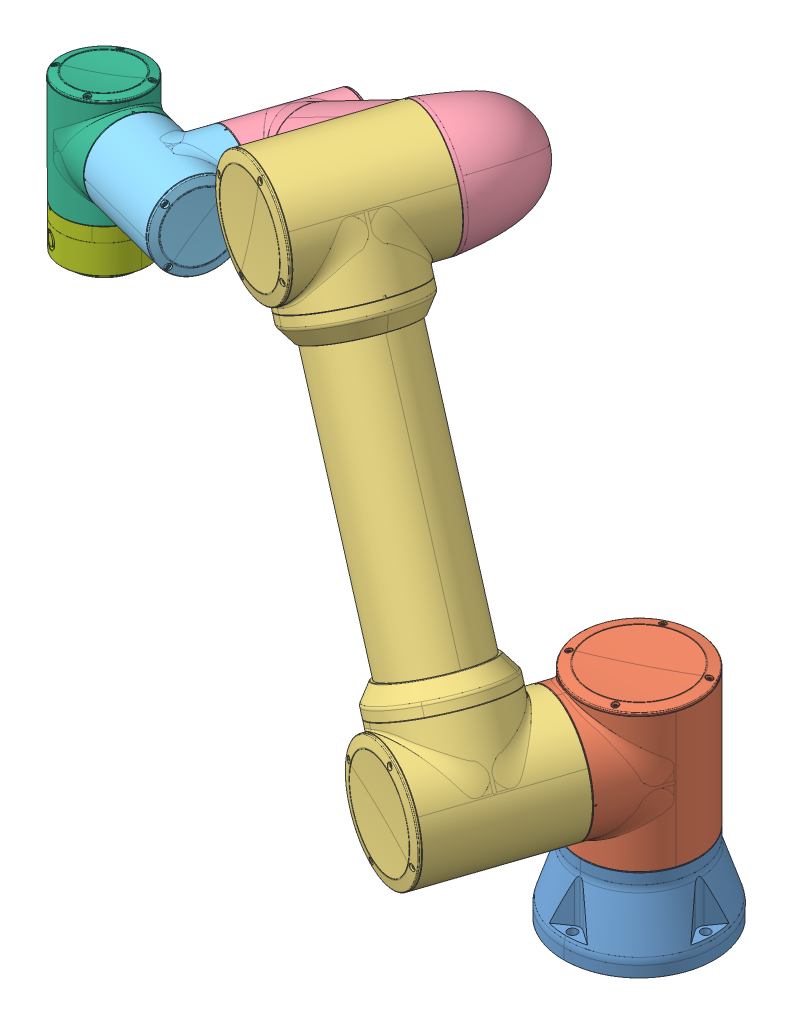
SolidWorks assembly FR5-V6.0 Model.SLDASM, configuration Výchozí (file format 8000). Lengths in mm.
Overall size (783.52 616.67 467.75).
7 component instances, 7 part files, 12 mates.
Components (placement in the parent):
- RD20-FR5-V6.0-1-1: RD20-FR5-V6.0-1.sldprt [Výchozí] at origin size (149.02 80.07 149)
- RD20-FR5-V6.0-2-1: RD20-FR5-V6.0-2.sldprt [Výchozí] at (0 0 0) x (0.947866 0 0.318668) z (-0.318668 0 0.947866) size (135.4 146.14 135.4)
- RD20-FR5-V6.0-3-1: RD20-FR5-V6.0-3.sldprt [Výchozí] at (-126.3044 78.9919 -42.6739) x (0.455276 -0.877095 0.153061) z (-0.318668 0 0.947866) size (560.4 135.4 146.14)
- RD20-FR5-V6.0-4-1: RD20-FR5-V6.0-4.sldprt [Výchozí] at (223.1313 627.4068 75.0156) x (0.796533 0.542055 0.26779) z (-0.318668 0 0.947866) size (498.16 116.97 117.84)
- RD20-FR5-V6.0-5-1: RD20-FR5-V6.0-5.sldprt [Výchozí] at (-575.4517 -520.2948 -193.6748) x (0.092682 -0.995208 0.031159) z (-0.318668 0 0.947866) size (90.04 111.24 93.82)
- RD20-FR5-V6.0-6-1: RD20-FR5-V6.0-6.sldprt [Výchozí] at (-427.4908 362.2401 -905.2501) x (0.322348 -0.042662 -0.945659) z (0.078937 -0.994293 0.071763) size (90.04 93.82 111.24)
- RD20-FR5-V6.0-7-1: RD20-FR5-V6.0-7.sldprt [Výchozí] at (-632.4178 247.9968 -102.8195) x (-0.847829 -0.029094 0.529472) z (0.524362 0.102638 0.845287) size (80.1 45.8 80.1)
Mates (geometry in assembly coordinates):
- Soustředná1: concentric anti-aligned: cylinder of RD20-FR5-V6.0-1-1 through (0 100.3904 0) axis (0 1 0) radius 55; cylinder of RD20-FR5-V6.0-2-1 through (0 213 0) axis (0 -1 0) radius 55
- Sjednocená1: coincident anti-aligned: plane of RD20-FR5-V6.0-1-1 through (-55 79 0) normal (0 1 0); plane of RD20-FR5-V6.0-2-1 through (0 79 0) normal (0 -1 0)
- Soustředná2: concentric anti-aligned: cylinder of RD20-FR5-V6.0-2-1 through (-19.4387 152 57.8199) axis (-0.318668 0 0.947866) radius 55; cylinder of RD20-FR5-V6.0-3-1 through (-63.3512 152 188.4359) axis (0.318668 0 -0.947866) radius 55
- Sjednocená2: coincident anti-aligned: plane of RD20-FR5-V6.0-2-1 through (-20.6497 152 61.4218) normal (-0.318668 0 0.947866); plane of RD20-FR5-V6.0-3-1 through (-20.6497 152 61.4218) normal (0.318668 0 -0.947866)
- Soustředná3: concentric anti-aligned: cylinder of RD20-FR5-V6.0-3-1 through (-256.8434 524.7655 123.3848) axis (0.318668 0 -0.947866) radius 55; cylinder of RD20-FR5-V6.0-4-1 through (-212.931 524.7655 -7.2312) axis (-0.318668 0 0.947866) radius 55
- Sjednocená3: coincident aligned: plane of RD20-FR5-V6.0-3-1 through (-214.1419 524.7655 -3.6293) normal (0.318668 0 -0.947866); plane of RD20-FR5-V6.0-4-1 through (-214.1419 524.7655 -3.6293) normal (0.318668 0 -0.947866)
- Soustředná4: concentric aligned: cylinder of RD20-FR5-V6.0-4-1 through (-491.2413 310.6484 -221.0678) axis (-0.318668 0 0.947866) radius 37.5; cylinder of RD20-FR5-V6.0-5-1 through (-525.0201 310.6484 -120.5939) axis (-0.318668 0 0.947866) radius 40
- Sjednocená4: coincident anti-aligned: plane of RD20-FR5-V6.0-4-1 through (-525.0201 310.6484 -120.5939) normal (-0.318668 0 0.947866); plane of RD20-FR5-V6.0-5-1 through (-525.0201 310.6484 -120.5939) normal (0.318668 0 -0.947866)
- Soustředná5: concentric anti-aligned: cylinder of RD20-FR5-V6.0-5-1 through (-490.5749 315.8307 -57.5296) axis (-0.943324 -0.09778 -0.317141) radius 37.5; cylinder of RD20-FR5-V6.0-6-1 through (-594.1519 305.0945 -92.3516) axis (0.943324 0.09778 0.317141) radius 37.5
- Sjednocená5: coincident anti-aligned: plane of RD20-FR5-V6.0-5-1 through (-590.5673 305.466 -91.1465) normal (-0.943324 -0.09778 -0.317141); plane of RD20-FR5-V6.0-6-1 through (-590.5673 305.466 -91.1465) normal (0.943324 0.09778 0.317141)
- Soustředná6: concentric anti-aligned: cylinder of RD20-FR5-V6.0-6-1 through (-640.7852 353.3919 -110.4264) axis (0.078937 -0.994293 0.071763) radius 37.5; cylinder of RD20-FR5-V6.0-7-1 through (-632.1179 244.2185 -102.5468) axis (-0.078937 0.994293 -0.071763) radius 37.5
- Sjednocená6: coincident aligned: plane of RD20-FR5-V6.0-6-1 through (-632.4178 247.9968 -102.8195) normal (0.078937 -0.994293 0.071763); plane of RD20-FR5-V6.0-7-1 through (-632.4178 247.9968 -102.8195) normal (0.078937 -0.994293 0.071763)
